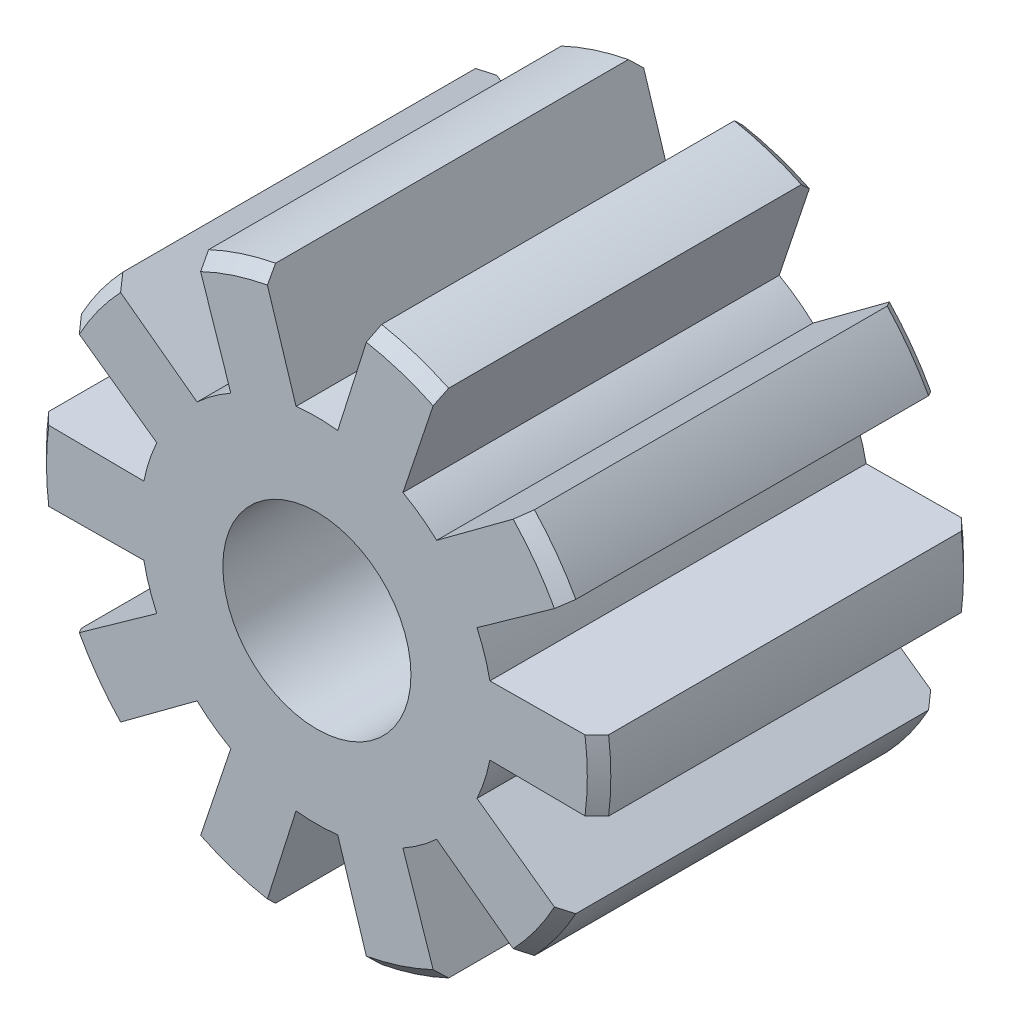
from build123d import *

# Parameters (mm, degrees)
ESQUISSE2_R            = 3
DIAM_TRE_DE_T_TE_DEPTH = 2
CHANFREINS_SIZE        = 0.125
CREUX_DENT_DEPTH       = 5.69041576
CREUX_DENT_DEPTH_BACK  = 5.69041576
R_P_TITION_COUNT       = 10
TROU_DEPTH             = 4
TROU_DEPTH_BACK        = 6.724677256
ESQUISSE4_R            = 1


with BuildPart() as part:
    # Esquisse2 → Diam_tre de t_te (new, symmetric)
    with BuildSketch(Plane.XY):
        Circle(ESQUISSE2_R)
    extrude(amount=DIAM_TRE_DE_T_TE_DEPTH, both=True)

    # Chanfreins
    chanfreins_edges = [part.edges().sort_by_distance(p)[0] for p in [
        (-3, 0, -2),
        (-3, 0, 2),
    ]]
    chamfer(chanfreins_edges, length=CHANFREINS_SIZE)

    # Esquisse3 → Creux dent (cut, two sides: drawn at the far end of the back side and taken through both)
    with BuildSketch(Plane.XY.offset(-CREUX_DENT_DEPTH_BACK)):
        with BuildLine():
            Line((-0.221693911, 1.861847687), (-0.563703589, 2.946563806))
            ThreePointArc((-0.563703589, 2.946563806), (0, 3), (0.563703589, 2.946563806))
            Line((0.563703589, 2.946563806), (0.221693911, 1.861847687))
            ThreePointArc((0.221693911, 1.861847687), (0, 1.875), (-0.221693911, 1.861847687))
        make_face()
    creux_dent = extrude(amount=CREUX_DENT_DEPTH + CREUX_DENT_DEPTH_BACK, mode=Mode.SUBTRACT)

    # R_p_tition: Creux dent ×10 about axis
    r_p_tition_axis = Axis((0, 0, 0), (0, 0, 1))
    for i in range(1, R_P_TITION_COUNT):
        add(creux_dent.rotate(r_p_tition_axis, i * 360 / R_P_TITION_COUNT), mode=Mode.SUBTRACT)

    # Esquisse4 → Trou (cut, two sides: drawn at the far end of the back side and taken through both)
    with BuildSketch(Plane(origin=(0, -1.5, 0), x_dir=(1, 0, 0), z_dir=(0, 0, -1)).offset(-TROU_DEPTH_BACK)):
        with Locations(Location((0, -1.5, 0), (0, 0, 180))):
            Circle(ESQUISSE4_R)
    extrude(amount=TROU_DEPTH + TROU_DEPTH_BACK, mode=Mode.SUBTRACT)


solid = part.part
